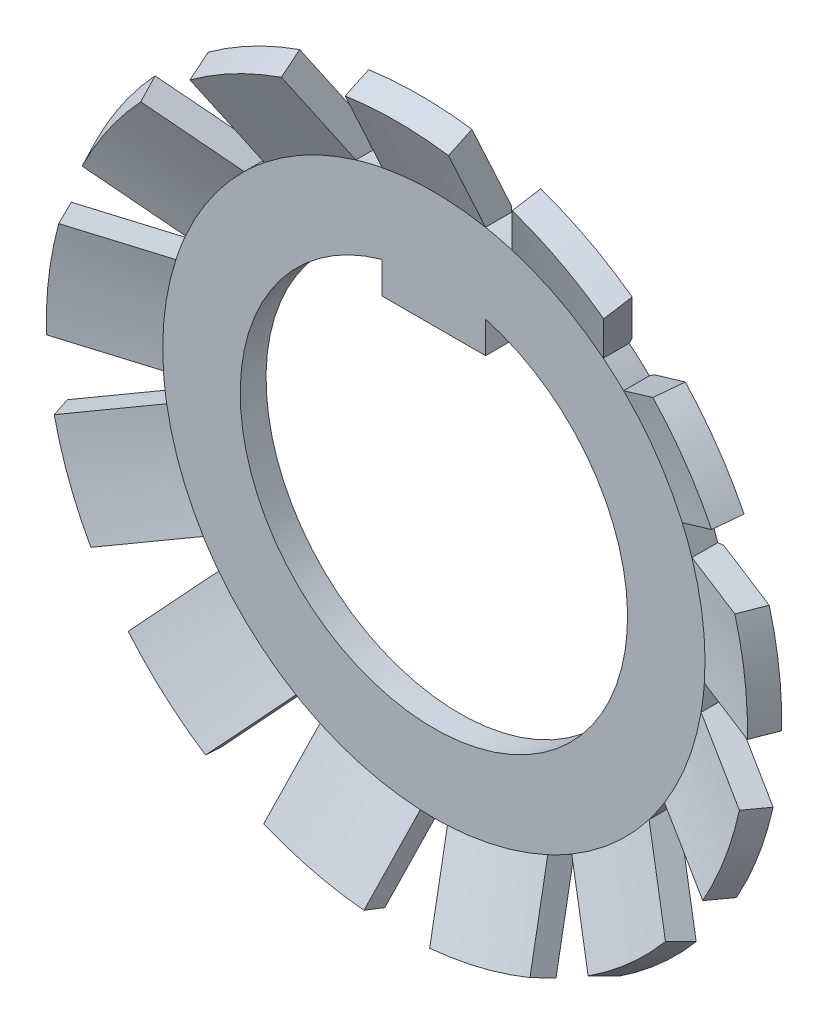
from build123d import *

# Parameters (mm, degrees)
BOSS_EXTRUDE1_DEPTH      = 2
BOSS_EXTRUDE1_DEPTH_BACK = 2
SKETCH3_R                = 28
CUT_EXTRUDE1_DEPTH       = 20


with BuildPart() as part:
    # Sketch1 → Revolve1 (revolve)
    with BuildSketch(Plane(origin=(0, 0, 0), x_dir=(0, 0, -1), z_dir=(1, 0, 0)), mode=Mode.PRIVATE) as revolve1_sk:
        Polygon((-2.435006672, 13.577381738), (-1, 10.5), (-1, 7.5), (0, 7.5), (0, 10.721694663), (-1.528698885, 14), align=None)
    revolve(revolve1_sk.sketch.rotate(Axis((0, 0, 0), (0, 0, 1)), 270), axis=Axis((0, 0, 0), (0, 0, 1)))

    # Sketch2 → Boss-Extrude1 (add, two sides: drawn at the far end of the back side and taken through both)
    with BuildSketch(Plane(origin=(0, 0, 0), x_dir=(0, 0, -1), z_dir=(1, 0, 0)).offset(-BOSS_EXTRUDE1_DEPTH_BACK)):
        Polygon((-1, 6), (1.5, 6), (1.5, 6.625), (0, 6.625), (0, 7.5), (-1, 7.5), align=None)
    extrude(amount=BOSS_EXTRUDE1_DEPTH + BOSS_EXTRUDE1_DEPTH_BACK)

    # Sketch3 → Cut-Extrude1 (cut)
    with BuildSketch(Plane.XY):
        Circle(SKETCH3_R)
        with BuildLine():
            Line((-13.996451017, -0.315212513), (-10.473682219, -0.742954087))
            ThreePointArc((-10.473682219, -0.742954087), (-10.423443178, -1.265635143), (-10.3471366, -1.785151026))
            Line((-10.3471366, -1.785151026), (-13.66517488, -3.043516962))
            ThreePointArc((-13.66517488, -3.043516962), (-13.090227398, -4.964468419), (-12.246755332, -6.783581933))
            Line((-12.246755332, -6.783581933), (-8.928717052, -5.525215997))
            ThreePointArc((-8.928717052, -5.525215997), (-8.641330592, -5.964679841), (-8.332333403, -6.389226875))
            Line((-8.332333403, -6.389226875), (-10.685518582, -9.04542385))
            ThreePointArc((-10.685518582, -9.04542385), (-9.283717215, -10.479150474), (-7.691475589, -11.697914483))
            Line((-7.691475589, -11.697914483), (-5.33829041, -9.041717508))
            ThreePointArc((-5.33829041, -9.041717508), (-4.879593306, -9.297288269), (-4.408693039, -9.529607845))
            Line((-4.408693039, -9.529607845), (-5.257938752, -12.975133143))
            ThreePointArc((-5.257938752, -12.975133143), (-3.3504193, -13.593185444), (-1.374171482, -13.9323958))
            Line((-1.374171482, -13.9323958), (-0.524925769, -10.486870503))
            ThreePointArc((-0.524925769, -10.486870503), (0, -10.5), (0.524925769, -10.486870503))
            Line((0.524925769, -10.486870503), (1.374171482, -13.9323958))
            ThreePointArc((1.374171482, -13.9323958), (3.3504193, -13.593185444), (5.257938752, -12.975133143))
            Line((5.257938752, -12.975133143), (4.408693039, -9.529607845))
            ThreePointArc((4.408693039, -9.529607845), (4.879593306, -9.297288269), (5.33829041, -9.041717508))
            Line((5.33829041, -9.041717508), (7.691475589, -11.697914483))
            ThreePointArc((7.691475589, -11.697914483), (9.283717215, -10.479150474), (10.685518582, -9.04542385))
            Line((10.685518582, -9.04542385), (8.332333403, -6.389226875))
            ThreePointArc((8.332333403, -6.389226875), (8.641330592, -5.964679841), (8.928717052, -5.525215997))
            Line((8.928717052, -5.525215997), (12.246755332, -6.783581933))
            ThreePointArc((12.246755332, -6.783581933), (13.090227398, -4.964468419), (13.66517488, -3.043516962))
            Line((13.66517488, -3.043516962), (10.3471366, -1.785151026))
            ThreePointArc((10.3471366, -1.785151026), (10.423443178, -1.265635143), (10.473682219, -0.742954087))
            Line((10.473682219, -0.742954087), (13.996451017, -0.315212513))
            ThreePointArc((13.996451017, -0.315212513), (13.897924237, 1.687513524), (13.514304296, 3.655622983))
            Line((13.514304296, 3.655622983), (9.991535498, 3.227881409))
            ThreePointArc((9.991535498, 3.227881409), (9.817670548, 3.723351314), (9.619253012, 4.209509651))
            Line((9.619253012, 4.209509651), (12.53972845, 6.225368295))
            ThreePointArc((12.53972845, 6.225368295), (11.521774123, 7.952906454), (10.267469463, 9.517303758))
            Line((10.267469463, 9.517303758), (7.346994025, 7.501445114))
            ThreePointArc((7.346994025, 7.501445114), (6.962787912, 7.859362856), (6.561168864, 8.197625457))
            Line((6.561168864, 8.197625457), (8.210305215, 11.33979225))
            ThreePointArc((8.210305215, 11.33979225), (6.506124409, 12.396384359), (4.668481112, 13.198684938))
            Line((4.668481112, 13.198684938), (3.019344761, 10.056518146))
            ThreePointArc((3.019344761, 10.056518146), (2.512814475, 10.194889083), (2, 10.307764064))
            Line((2, 10.307764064), (2, 13.856406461))
            ThreePointArc((2, 13.856406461), (0, 14), (-2, 13.856406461))
            Line((-2, 13.856406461), (-2, 10.307764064))
            ThreePointArc((-2, 10.307764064), (-2.512814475, 10.194889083), (-3.019344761, 10.056518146))
            Line((-3.019344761, 10.056518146), (-4.668481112, 13.198684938))
            ThreePointArc((-4.668481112, 13.198684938), (-6.506124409, 12.396384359), (-8.210305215, 11.33979225))
            Line((-8.210305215, 11.33979225), (-6.561168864, 8.197625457))
            ThreePointArc((-6.561168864, 8.197625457), (-6.962787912, 7.859362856), (-7.346994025, 7.501445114))
            Line((-7.346994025, 7.501445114), (-10.267469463, 9.517303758))
            ThreePointArc((-10.267469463, 9.517303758), (-11.521774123, 7.952906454), (-12.53972845, 6.225368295))
            Line((-12.53972845, 6.225368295), (-9.619253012, 4.209509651))
            ThreePointArc((-9.619253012, 4.209509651), (-9.817670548, 3.723351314), (-9.991535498, 3.227881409))
            Line((-9.991535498, 3.227881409), (-13.514304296, 3.655622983))
            ThreePointArc((-13.514304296, 3.655622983), (-13.897924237, 1.687513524), (-13.996451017, -0.315212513))
        make_face(mode=Mode.SUBTRACT)
    extrude(amount=CUT_EXTRUDE1_DEPTH, mode=Mode.SUBTRACT)


solid = part.part
